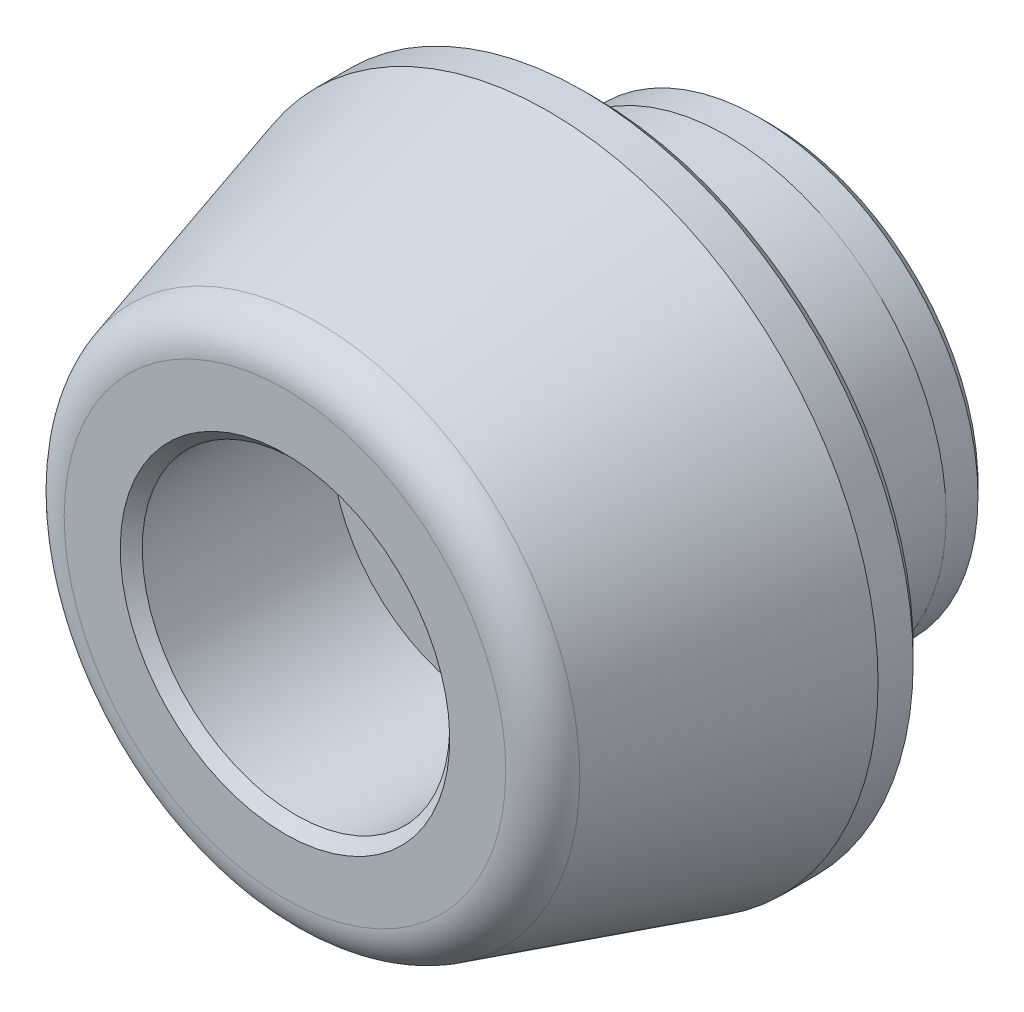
ISO-10303-21;
HEADER;
FILE_DESCRIPTION(('STEP AP214'),'2;1');
FILE_NAME('part.step','',(''),(''),'','','');
FILE_SCHEMA(('AUTOMOTIVE_DESIGN { 1 0 10303 214 1 1 1 1 }'));
ENDSEC;
DATA;
#1=APPLICATION_CONTEXT('core data for automotive mechanical design processes');
#2=APPLICATION_PROTOCOL_DEFINITION('international standard','automotive_design',2000,#1);
#3=PRODUCT_CONTEXT('',#1,'mechanical');
#4=PRODUCT('Part','Part','',(#3));
#5=PRODUCT_RELATED_PRODUCT_CATEGORY('part','',(#4));
#6=PRODUCT_DEFINITION_FORMATION('','',#4);
#7=PRODUCT_DEFINITION_CONTEXT('part definition',#1,'design');
#8=PRODUCT_DEFINITION('design','',#6,#7);
#9=PRODUCT_DEFINITION_SHAPE('','',#8);
#10=(LENGTH_UNIT() NAMED_UNIT(*) SI_UNIT(.MILLI.,.METRE.));
#11=(NAMED_UNIT(*) PLANE_ANGLE_UNIT() SI_UNIT($,.RADIAN.));
#12=(NAMED_UNIT(*) SI_UNIT($,.STERADIAN.) SOLID_ANGLE_UNIT());
#13=UNCERTAINTY_MEASURE_WITH_UNIT(LENGTH_MEASURE(1.E-05),#10,'distance_accuracy_value','');
#14=(GEOMETRIC_REPRESENTATION_CONTEXT(3) GLOBAL_UNCERTAINTY_ASSIGNED_CONTEXT((#13)) GLOBAL_UNIT_ASSIGNED_CONTEXT((#10,
#11,#12)) REPRESENTATION_CONTEXT('',''));
#15=CARTESIAN_POINT('',(0.,0.,0.));
#16=DIRECTION('',(0.,0.,1.));
#17=DIRECTION('',(1.,0.,0.));
#18=AXIS2_PLACEMENT_3D('',#15,#16,#17);
#19=CARTESIAN_POINT('',(0.,0.,22.1));
#20=DIRECTION('',(0.,0.,1.));
#21=DIRECTION('',(0.,-1.,0.));
#22=AXIS2_PLACEMENT_3D('',#19,#20,#21);
#23=CYLINDRICAL_SURFACE('',#22,4.25);
#24=CARTESIAN_POINT('',(0.,0.,1.));
#25=DIRECTION('',(0.,0.,-1.));
#26=DIRECTION('',(0.,1.,0.));
#27=AXIS2_PLACEMENT_3D('',#24,#25,#26);
#28=CIRCLE('',#27,4.25);
#29=CARTESIAN_POINT('',(0.,4.25,1.00000000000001));
#30=VERTEX_POINT('',#29);
#31=EDGE_CURVE('E8',#30,#30,#28,.T.);
#32=ORIENTED_EDGE('',*,*,#31,.T.);
#33=EDGE_LOOP('',(#32));
#34=FACE_BOUND('',#33,.T.);
#35=CARTESIAN_POINT('',(0.,0.,12.5));
#36=DIRECTION('',(0.,0.,1.));
#37=DIRECTION('',(0.,-1.,0.));
#38=AXIS2_PLACEMENT_3D('',#35,#36,#37);
#39=CIRCLE('',#38,4.25);
#40=CARTESIAN_POINT('',(0.,-4.25000000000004,12.5));
#41=VERTEX_POINT('',#40);
#42=EDGE_CURVE('E33',#41,#41,#39,.T.);
#43=ORIENTED_EDGE('',*,*,#42,.T.);
#44=EDGE_LOOP('',(#43));
#45=FACE_BOUND('',#44,.T.);
#46=ADVANCED_FACE('F13',(#34,#45),#23,.F.);
#47=CARTESIAN_POINT('',(0.,0.,0.));
#48=DIRECTION('',(0.,0.,-1.));
#49=DIRECTION('',(0.,1.,0.));
#50=AXIS2_PLACEMENT_3D('',#47,#48,#49);
#51=CYLINDRICAL_SURFACE('',#50,10.);
#52=CARTESIAN_POINT('',(0.,0.,6.8));
#53=DIRECTION('',(0.,0.,-1.));
#54=DIRECTION('',(0.,1.,0.));
#55=AXIS2_PLACEMENT_3D('',#52,#53,#54);
#56=CIRCLE('',#55,10.);
#57=CARTESIAN_POINT('',(0.,9.99999999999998,6.80000000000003));
#58=VERTEX_POINT('',#57);
#59=EDGE_CURVE('E81',#58,#58,#56,.T.);
#60=ORIENTED_EDGE('',*,*,#59,.T.);
#61=EDGE_LOOP('',(#60));
#62=FACE_BOUND('',#61,.T.);
#63=CARTESIAN_POINT('',(0.,0.,2.));
#64=DIRECTION('',(0.,0.,-1.));
#65=DIRECTION('',(0.,1.,0.));
#66=AXIS2_PLACEMENT_3D('',#63,#64,#65);
#67=CIRCLE('',#66,10.);
#68=CARTESIAN_POINT('',(0.,9.99999999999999,2.00000000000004));
#69=VERTEX_POINT('',#68);
#70=EDGE_CURVE('E63',#69,#69,#67,.T.);
#71=ORIENTED_EDGE('',*,*,#70,.F.);
#72=EDGE_LOOP('',(#71));
#73=FACE_BOUND('',#72,.T.);
#74=ADVANCED_FACE('F85',(#62,#73),#51,.T.);
#75=CARTESIAN_POINT('',(0.,0.,0.));
#76=DIRECTION('',(0.,0.,-1.));
#77=DIRECTION('',(0.,1.,0.));
#78=AXIS2_PLACEMENT_3D('',#75,#76,#77);
#79=PLANE('',#78);
#80=CARTESIAN_POINT('',(0.,0.,0.));
#81=DIRECTION('',(0.,0.,-1.));
#82=DIRECTION('',(0.,1.,0.));
#83=AXIS2_PLACEMENT_3D('',#80,#81,#82);
#84=CIRCLE('',#83,5.25);
#85=CARTESIAN_POINT('',(0.,5.25,0.));
#86=VERTEX_POINT('',#85);
#87=EDGE_CURVE('E20',#86,#86,#84,.F.);
#88=ORIENTED_EDGE('',*,*,#87,.T.);
#89=EDGE_LOOP('',(#88));
#90=FACE_BOUND('',#89,.T.);
#91=CARTESIAN_POINT('',(0.,0.,0.));
#92=DIRECTION('',(0.,0.,-1.));
#93=DIRECTION('',(0.,1.,0.));
#94=AXIS2_PLACEMENT_3D('',#91,#92,#93);
#95=CIRCLE('',#94,9.45);
#96=CARTESIAN_POINT('',(0.,9.45,0.));
#97=VERTEX_POINT('',#96);
#98=EDGE_CURVE('E54',#97,#97,#95,.T.);
#99=ORIENTED_EDGE('',*,*,#98,.T.);
#100=EDGE_LOOP('',(#99));
#101=FACE_BOUND('',#100,.T.);
#102=ADVANCED_FACE('F145',(#90,#101),#79,.T.);
#103=CARTESIAN_POINT('',(0.,0.,22.1));
#104=DIRECTION('',(0.,0.,1.));
#105=DIRECTION('',(0.,-1.,0.));
#106=AXIS2_PLACEMENT_3D('',#103,#104,#105);
#107=PLANE('',#106);
#108=CARTESIAN_POINT('',(0.,0.,22.1));
#109=DIRECTION('',(0.,0.,1.));
#110=DIRECTION('',(0.,-1.,0.));
#111=AXIS2_PLACEMENT_3D('',#108,#109,#110);
#112=CIRCLE('',#111,7.5);
#113=CARTESIAN_POINT('',(0.,-7.50000000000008,22.1));
#114=VERTEX_POINT('',#113);
#115=EDGE_CURVE('E24',#114,#114,#112,.F.);
#116=ORIENTED_EDGE('',*,*,#115,.T.);
#117=EDGE_LOOP('',(#116));
#118=FACE_BOUND('',#117,.T.);
#119=CARTESIAN_POINT('',(0.,0.,22.1));
#120=DIRECTION('',(0.,0.,1.));
#121=DIRECTION('',(0.,-1.,0.));
#122=AXIS2_PLACEMENT_3D('',#119,#120,#121);
#123=CIRCLE('',#122,10.0519472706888);
#124=CARTESIAN_POINT('',(0.,-10.0519472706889,22.1));
#125=VERTEX_POINT('',#124);
#126=EDGE_CURVE('E39',#125,#125,#123,.T.);
#127=ORIENTED_EDGE('',*,*,#126,.T.);
#128=EDGE_LOOP('',(#127));
#129=FACE_BOUND('',#128,.T.);
#130=ADVANCED_FACE('F152',(#118,#129),#107,.T.);
#131=CARTESIAN_POINT('',(0.,0.,10.1));
#132=DIRECTION('',(0.,0.,-1.));
#133=DIRECTION('',(0.,1.,0.));
#134=AXIS2_PLACEMENT_3D('',#131,#132,#133);
#135=CONICAL_SURFACE('',#134,15.,0.279252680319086);
#136=CARTESIAN_POINT('',(0.,0.,20.651274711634));
#137=DIRECTION('',(0.,0.,1.));
#138=DIRECTION('',(0.,-1.,0.));
#139=AXIS2_PLACEMENT_3D('',#136,#137,#138);
#140=CIRCLE('',#139,11.9744706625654);
#141=CARTESIAN_POINT('',(0.,-11.9744706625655,20.651274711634));
#142=VERTEX_POINT('',#141);
#143=EDGE_CURVE('E42',#142,#142,#140,.F.);
#144=ORIENTED_EDGE('',*,*,#143,.T.);
#145=EDGE_LOOP('',(#144));
#146=FACE_BOUND('',#145,.T.);
#147=CARTESIAN_POINT('',(0.,0.,10.1));
#148=DIRECTION('',(0.,0.,-1.));
#149=DIRECTION('',(0.,1.,0.));
#150=AXIS2_PLACEMENT_3D('',#147,#148,#149);
#151=CIRCLE('',#150,15.);
#152=CARTESIAN_POINT('',(0.,15.,10.1000000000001));
#153=VERTEX_POINT('',#152);
#154=EDGE_CURVE('E57',#153,#153,#151,.T.);
#155=ORIENTED_EDGE('',*,*,#154,.F.);
#156=EDGE_LOOP('',(#155));
#157=FACE_BOUND('',#156,.T.);
#158=ADVANCED_FACE('F156',(#146,#157),#135,.T.);
#159=CARTESIAN_POINT('',(0.,0.,0.));
#160=DIRECTION('',(0.,0.,-1.));
#161=DIRECTION('',(0.,1.,0.));
#162=AXIS2_PLACEMENT_3D('',#159,#160,#161);
#163=CYLINDRICAL_SURFACE('',#162,15.);
#164=CARTESIAN_POINT('',(0.,0.,8.5));
#165=DIRECTION('',(0.,0.,-1.));
#166=DIRECTION('',(0.,1.,0.));
#167=AXIS2_PLACEMENT_3D('',#164,#165,#166);
#168=CIRCLE('',#167,15.);
#169=CARTESIAN_POINT('',(0.,15.,8.50000000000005));
#170=VERTEX_POINT('',#169);
#171=EDGE_CURVE('E45',#170,#170,#168,.F.);
#172=ORIENTED_EDGE('',*,*,#171,.T.);
#173=EDGE_LOOP('',(#172));
#174=FACE_BOUND('',#173,.T.);
#175=ORIENTED_EDGE('',*,*,#154,.T.);
#176=EDGE_LOOP('',(#175));
#177=FACE_BOUND('',#176,.T.);
#178=ADVANCED_FACE('F118',(#174,#177),#163,.T.);
#179=CARTESIAN_POINT('',(15.,0.,8.));
#180=DIRECTION('',(0.,0.,-1.));
#181=DIRECTION('',(0.,1.,0.));
#182=AXIS2_PLACEMENT_3D('',#179,#180,#181);
#183=PLANE('',#182);
#184=CARTESIAN_POINT('',(0.,0.,8.));
#185=DIRECTION('',(0.,0.,-1.));
#186=DIRECTION('',(0.,1.,0.));
#187=AXIS2_PLACEMENT_3D('',#184,#185,#186);
#188=CIRCLE('',#187,10.8);
#189=CARTESIAN_POINT('',(0.,10.8,8.00000000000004));
#190=VERTEX_POINT('',#189);
#191=EDGE_CURVE('E69',#190,#190,#188,.T.);
#192=ORIENTED_EDGE('',*,*,#191,.F.);
#193=EDGE_LOOP('',(#192));
#194=FACE_BOUND('',#193,.T.);
#195=CARTESIAN_POINT('',(0.,0.,8.));
#196=DIRECTION('',(0.,0.,-1.));
#197=DIRECTION('',(0.,1.,0.));
#198=AXIS2_PLACEMENT_3D('',#195,#196,#197);
#199=CIRCLE('',#198,14.5);
#200=CARTESIAN_POINT('',(0.,14.5,8.00000000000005));
#201=VERTEX_POINT('',#200);
#202=EDGE_CURVE('E48',#201,#201,#199,.T.);
#203=ORIENTED_EDGE('',*,*,#202,.T.);
#204=EDGE_LOOP('',(#203));
#205=FACE_BOUND('',#204,.T.);
#206=ADVANCED_FACE('F114',(#194,#205),#183,.T.);
#207=CARTESIAN_POINT('',(0.,0.,0.));
#208=DIRECTION('',(0.,0.,-1.));
#209=DIRECTION('',(0.,1.,0.));
#210=AXIS2_PLACEMENT_3D('',#207,#208,#209);
#211=CYLINDRICAL_SURFACE('',#210,9.95);
#212=CARTESIAN_POINT('',(0.,0.,0.499999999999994));
#213=DIRECTION('',(0.,0.,-1.));
#214=DIRECTION('',(0.,1.,0.));
#215=AXIS2_PLACEMENT_3D('',#212,#213,#214);
#216=CIRCLE('',#215,9.95);
#217=CARTESIAN_POINT('',(0.,9.95,0.500000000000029));
#218=VERTEX_POINT('',#217);
#219=EDGE_CURVE('E51',#218,#218,#216,.F.);
#220=ORIENTED_EDGE('',*,*,#219,.T.);
#221=EDGE_LOOP('',(#220));
#222=FACE_BOUND('',#221,.T.);
#223=CARTESIAN_POINT('',(0.,0.,2.));
#224=DIRECTION('',(0.,0.,-1.));
#225=DIRECTION('',(0.,1.,0.));
#226=AXIS2_PLACEMENT_3D('',#223,#224,#225);
#227=CIRCLE('',#226,9.95);
#228=CARTESIAN_POINT('',(0.,9.94999999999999,2.00000000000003));
#229=VERTEX_POINT('',#228);
#230=EDGE_CURVE('E60',#229,#229,#227,.T.);
#231=ORIENTED_EDGE('',*,*,#230,.T.);
#232=EDGE_LOOP('',(#231));
#233=FACE_BOUND('',#232,.T.);
#234=ADVANCED_FACE('F117',(#222,#233),#211,.T.);
#235=CARTESIAN_POINT('',(-9.95,0.,2.));
#236=DIRECTION('',(0.,0.,-1.));
#237=DIRECTION('',(0.,1.,0.));
#238=AXIS2_PLACEMENT_3D('',#235,#236,#237);
#239=PLANE('',#238);
#240=ORIENTED_EDGE('',*,*,#70,.T.);
#241=EDGE_LOOP('',(#240));
#242=FACE_BOUND('',#241,.T.);
#243=ORIENTED_EDGE('',*,*,#230,.F.);
#244=EDGE_LOOP('',(#243));
#245=FACE_BOUND('',#244,.T.);
#246=ADVANCED_FACE('F187',(#242,#245),#239,.T.);
#247=CARTESIAN_POINT('',(0.,0.,13.));
#248=DIRECTION('',(0.,0.,1.));
#249=DIRECTION('',(0.,-1.,0.));
#250=AXIS2_PLACEMENT_3D('',#247,#248,#249);
#251=PLANE('',#250);
#252=CARTESIAN_POINT('',(0.,0.,13.));
#253=DIRECTION('',(0.,0.,1.));
#254=DIRECTION('',(0.,-1.,0.));
#255=AXIS2_PLACEMENT_3D('',#252,#253,#254);
#256=CIRCLE('',#255,4.75);
#257=CARTESIAN_POINT('',(0.,-4.75000000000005,13.));
#258=VERTEX_POINT('',#257);
#259=EDGE_CURVE('E36',#258,#258,#256,.F.);
#260=ORIENTED_EDGE('',*,*,#259,.T.);
#261=EDGE_LOOP('',(#260));
#262=FACE_BOUND('',#261,.T.);
#263=CARTESIAN_POINT('',(0.,0.,13.));
#264=DIRECTION('',(0.,0.,1.));
#265=DIRECTION('',(0.,-1.,0.));
#266=AXIS2_PLACEMENT_3D('',#263,#264,#265);
#267=CIRCLE('',#266,7.);
#268=CARTESIAN_POINT('',(0.,-7.00000000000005,13.));
#269=VERTEX_POINT('',#268);
#270=EDGE_CURVE('E66',#269,#269,#267,.T.);
#271=ORIENTED_EDGE('',*,*,#270,.T.);
#272=EDGE_LOOP('',(#271));
#273=FACE_BOUND('',#272,.T.);
#274=ADVANCED_FACE('F182',(#262,#273),#251,.T.);
#275=CARTESIAN_POINT('',(0.,0.,13.));
#276=DIRECTION('',(0.,0.,1.));
#277=DIRECTION('',(0.,-1.,0.));
#278=AXIS2_PLACEMENT_3D('',#275,#276,#277);
#279=CYLINDRICAL_SURFACE('',#278,7.);
#280=CARTESIAN_POINT('',(0.,0.,21.6));
#281=DIRECTION('',(0.,0.,1.));
#282=DIRECTION('',(0.,-1.,0.));
#283=AXIS2_PLACEMENT_3D('',#280,#281,#282);
#284=CIRCLE('',#283,7.);
#285=CARTESIAN_POINT('',(0.,-7.00000000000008,21.6));
#286=VERTEX_POINT('',#285);
#287=EDGE_CURVE('E28',#286,#286,#284,.T.);
#288=ORIENTED_EDGE('',*,*,#287,.T.);
#289=EDGE_LOOP('',(#288));
#290=FACE_BOUND('',#289,.T.);
#291=ORIENTED_EDGE('',*,*,#270,.F.);
#292=EDGE_LOOP('',(#291));
#293=FACE_BOUND('',#292,.T.);
#294=ADVANCED_FACE('F135',(#290,#293),#279,.F.);
#295=CARTESIAN_POINT('',(0.,0.,0.));
#296=DIRECTION('',(0.,0.,1.));
#297=DIRECTION('',(0.,-1.,0.));
#298=AXIS2_PLACEMENT_3D('',#295,#296,#297);
#299=CONICAL_SURFACE('',#298,9.45,0.785398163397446);
#300=ORIENTED_EDGE('',*,*,#219,.F.);
#301=EDGE_LOOP('',(#300));
#302=FACE_BOUND('',#301,.T.);
#303=ORIENTED_EDGE('',*,*,#98,.F.);
#304=EDGE_LOOP('',(#303));
#305=FACE_BOUND('',#304,.T.);
#306=ADVANCED_FACE('F124',(#302,#305),#299,.T.);
#307=CARTESIAN_POINT('',(0.,0.,8.));
#308=DIRECTION('',(0.,0.,1.));
#309=DIRECTION('',(0.,-1.,0.));
#310=AXIS2_PLACEMENT_3D('',#307,#308,#309);
#311=CONICAL_SURFACE('',#310,14.5,0.785398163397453);
#312=ORIENTED_EDGE('',*,*,#171,.F.);
#313=EDGE_LOOP('',(#312));
#314=FACE_BOUND('',#313,.T.);
#315=ORIENTED_EDGE('',*,*,#202,.F.);
#316=EDGE_LOOP('',(#315));
#317=FACE_BOUND('',#316,.T.);
#318=ADVANCED_FACE('F122',(#314,#317),#311,.T.);
#319=CARTESIAN_POINT('',(0.,0.,20.1));
#320=DIRECTION('',(0.,0.,1.));
#321=DIRECTION('',(0.,-1.,0.));
#322=AXIS2_PLACEMENT_3D('',#319,#320,#321);
#323=TOROIDAL_SURFACE('',#322,10.0519472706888,2.);
#324=ORIENTED_EDGE('',*,*,#126,.F.);
#325=EDGE_LOOP('',(#324));
#326=FACE_BOUND('',#325,.T.);
#327=ORIENTED_EDGE('',*,*,#143,.F.);
#328=EDGE_LOOP('',(#327));
#329=FACE_BOUND('',#328,.T.);
#330=ADVANCED_FACE('F110',(#326,#329),#323,.T.);
#331=CARTESIAN_POINT('',(0.,0.,8.));
#332=DIRECTION('',(0.,0.,-1.));
#333=DIRECTION('',(0.,1.,0.));
#334=AXIS2_PLACEMENT_3D('',#331,#332,#333);
#335=CONICAL_SURFACE('',#334,10.8,1.00261735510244);
#336=CARTESIAN_POINT('',(0.,0.,8.43715290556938));
#337=DIRECTION('',(0.,0.,-1.));
#338=DIRECTION('',(0.,1.,0.));
#339=AXIS2_PLACEMENT_3D('',#336,#337,#338);
#340=CIRCLE('',#339,10.1152392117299);
#341=CARTESIAN_POINT('',(0.,10.1152392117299,8.43715290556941));
#342=VERTEX_POINT('',#341);
#343=EDGE_CURVE('E72',#342,#342,#340,.T.);
#344=ORIENTED_EDGE('',*,*,#343,.F.);
#345=EDGE_LOOP('',(#344));
#346=FACE_BOUND('',#345,.T.);
#347=ORIENTED_EDGE('',*,*,#191,.T.);
#348=EDGE_LOOP('',(#347));
#349=FACE_BOUND('',#348,.T.);
#350=ADVANCED_FACE('F104',(#346,#349),#335,.F.);
#351=CARTESIAN_POINT('',(0.,0.,8.1));
#352=DIRECTION('',(0.,0.,-1.));
#353=DIRECTION('',(0.,1.,0.));
#354=AXIS2_PLACEMENT_3D('',#351,#352,#353);
#355=TOROIDAL_SURFACE('',#354,9.9,0.4);
#356=CARTESIAN_POINT('',(0.,0.,8.1));
#357=DIRECTION('',(0.,0.,-1.));
#358=DIRECTION('',(0.,1.,0.));
#359=AXIS2_PLACEMENT_3D('',#356,#357,#358);
#360=CIRCLE('',#359,9.5);
#361=CARTESIAN_POINT('',(0.,9.49999999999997,8.10000000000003));
#362=VERTEX_POINT('',#361);
#363=EDGE_CURVE('E75',#362,#362,#360,.T.);
#364=ORIENTED_EDGE('',*,*,#363,.F.);
#365=EDGE_LOOP('',(#364));
#366=FACE_BOUND('',#365,.T.);
#367=ORIENTED_EDGE('',*,*,#343,.T.);
#368=EDGE_LOOP('',(#367));
#369=FACE_BOUND('',#368,.T.);
#370=ADVANCED_FACE('F98',(#366,#369),#355,.F.);
#371=CARTESIAN_POINT('',(0.,0.,0.));
#372=DIRECTION('',(0.,0.,-1.));
#373=DIRECTION('',(0.,1.,0.));
#374=AXIS2_PLACEMENT_3D('',#371,#372,#373);
#375=CYLINDRICAL_SURFACE('',#374,9.5);
#376=CARTESIAN_POINT('',(0.,0.,7.66602540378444));
#377=DIRECTION('',(0.,0.,-1.));
#378=DIRECTION('',(0.,1.,0.));
#379=AXIS2_PLACEMENT_3D('',#376,#377,#378);
#380=CIRCLE('',#379,9.5);
#381=CARTESIAN_POINT('',(0.,9.49999999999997,7.66602540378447));
#382=VERTEX_POINT('',#381);
#383=EDGE_CURVE('E78',#382,#382,#380,.T.);
#384=ORIENTED_EDGE('',*,*,#383,.F.);
#385=EDGE_LOOP('',(#384));
#386=FACE_BOUND('',#385,.T.);
#387=ORIENTED_EDGE('',*,*,#363,.T.);
#388=EDGE_LOOP('',(#387));
#389=FACE_BOUND('',#388,.T.);
#390=ADVANCED_FACE('F92',(#386,#389),#375,.T.);
#391=CARTESIAN_POINT('',(0.,0.,7.66602540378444));
#392=DIRECTION('',(0.,0.,-1.));
#393=DIRECTION('',(0.,1.,0.));
#394=AXIS2_PLACEMENT_3D('',#391,#392,#393);
#395=CONICAL_SURFACE('',#394,9.5,0.523598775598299);
#396=ORIENTED_EDGE('',*,*,#59,.F.);
#397=EDGE_LOOP('',(#396));
#398=FACE_BOUND('',#397,.T.);
#399=ORIENTED_EDGE('',*,*,#383,.T.);
#400=EDGE_LOOP('',(#399));
#401=FACE_BOUND('',#400,.T.);
#402=ADVANCED_FACE('F88',(#398,#401),#395,.T.);
#403=CARTESIAN_POINT('',(0.,0.,13.));
#404=DIRECTION('',(0.,0.,1.));
#405=DIRECTION('',(0.,-1.,0.));
#406=AXIS2_PLACEMENT_3D('',#403,#404,#405);
#407=CONICAL_SURFACE('',#406,4.75,0.785398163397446);
#408=ORIENTED_EDGE('',*,*,#42,.F.);
#409=EDGE_LOOP('',(#408));
#410=FACE_BOUND('',#409,.T.);
#411=ORIENTED_EDGE('',*,*,#259,.F.);
#412=EDGE_LOOP('',(#411));
#413=FACE_BOUND('',#412,.T.);
#414=ADVANCED_FACE('F91',(#410,#413),#407,.F.);
#415=CARTESIAN_POINT('',(0.,0.,21.6));
#416=DIRECTION('',(0.,0.,1.));
#417=DIRECTION('',(0.,-1.,0.));
#418=AXIS2_PLACEMENT_3D('',#415,#416,#417);
#419=CONICAL_SURFACE('',#418,7.,0.785398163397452);
#420=ORIENTED_EDGE('',*,*,#115,.F.);
#421=EDGE_LOOP('',(#420));
#422=FACE_BOUND('',#421,.T.);
#423=ORIENTED_EDGE('',*,*,#287,.F.);
#424=EDGE_LOOP('',(#423));
#425=FACE_BOUND('',#424,.T.);
#426=ADVANCED_FACE('F175',(#422,#425),#419,.F.);
#427=CARTESIAN_POINT('',(0.,0.,0.));
#428=DIRECTION('',(0.,0.,-1.));
#429=DIRECTION('',(0.,1.,0.));
#430=AXIS2_PLACEMENT_3D('',#427,#428,#429);
#431=CONICAL_SURFACE('',#430,5.25,0.785398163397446);
#432=ORIENTED_EDGE('',*,*,#31,.F.);
#433=EDGE_LOOP('',(#432));
#434=FACE_BOUND('',#433,.T.);
#435=ORIENTED_EDGE('',*,*,#87,.F.);
#436=EDGE_LOOP('',(#435));
#437=FACE_BOUND('',#436,.T.);
#438=ADVANCED_FACE('F15',(#434,#437),#431,.F.);
#439=CLOSED_SHELL('',(#46,#74,#102,#130,#158,#178,#206,#234,#246,#274,#294,#306,#318,#330,#350,
#370,#390,#402,#414,#426,#438));
#440=MANIFOLD_SOLID_BREP('B1',#439);
#441=ADVANCED_BREP_SHAPE_REPRESENTATION('',(#18,#440),#14);
#442=SHAPE_DEFINITION_REPRESENTATION(#9,#441);
ENDSEC;
END-ISO-10303-21;
